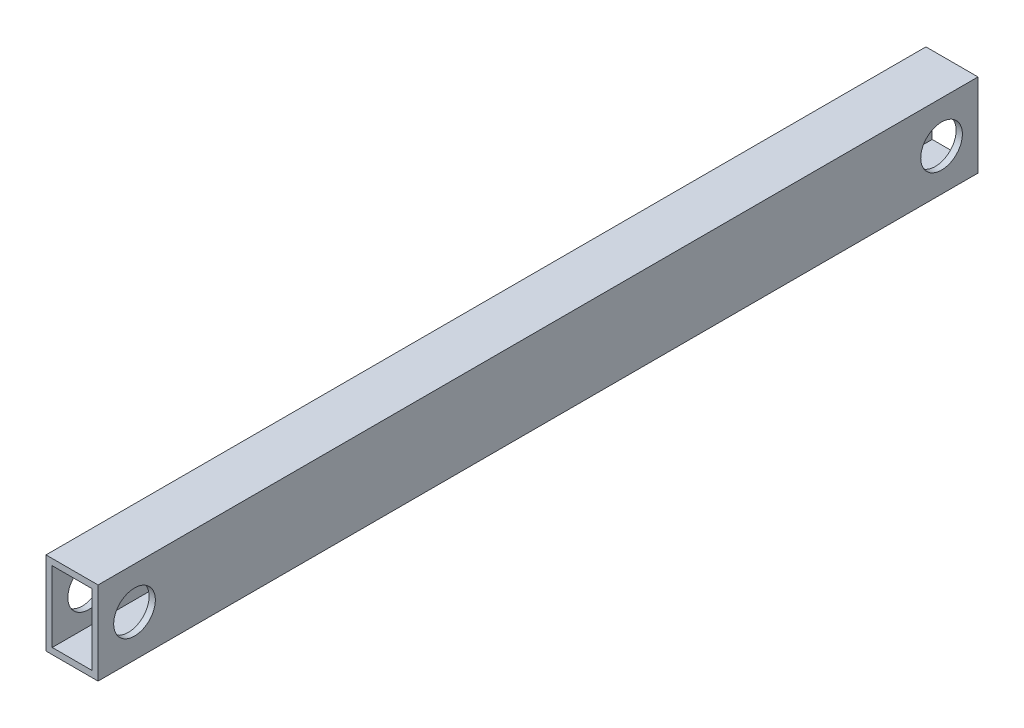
ISO-10303-21;
HEADER;
FILE_DESCRIPTION(('STEP AP214'),'2;1');
FILE_NAME('part.step','',(''),(''),'','','');
FILE_SCHEMA(('AUTOMOTIVE_DESIGN { 1 0 10303 214 1 1 1 1 }'));
ENDSEC;
DATA;
#1=APPLICATION_CONTEXT('core data for automotive mechanical design processes');
#2=APPLICATION_PROTOCOL_DEFINITION('international standard','automotive_design',2000,#1);
#3=PRODUCT_CONTEXT('',#1,'mechanical');
#4=PRODUCT('Part','Part','',(#3));
#5=PRODUCT_RELATED_PRODUCT_CATEGORY('part','',(#4));
#6=PRODUCT_DEFINITION_FORMATION('','',#4);
#7=PRODUCT_DEFINITION_CONTEXT('part definition',#1,'design');
#8=PRODUCT_DEFINITION('design','',#6,#7);
#9=PRODUCT_DEFINITION_SHAPE('','',#8);
#10=(LENGTH_UNIT() NAMED_UNIT(*) SI_UNIT(.MILLI.,.METRE.));
#11=(NAMED_UNIT(*) PLANE_ANGLE_UNIT() SI_UNIT($,.RADIAN.));
#12=(NAMED_UNIT(*) SI_UNIT($,.STERADIAN.) SOLID_ANGLE_UNIT());
#13=UNCERTAINTY_MEASURE_WITH_UNIT(LENGTH_MEASURE(1.E-05),#10,'distance_accuracy_value','');
#14=(GEOMETRIC_REPRESENTATION_CONTEXT(3) GLOBAL_UNCERTAINTY_ASSIGNED_CONTEXT((#13)) GLOBAL_UNIT_ASSIGNED_CONTEXT((#10,
#11,#12)) REPRESENTATION_CONTEXT('',''));
#15=CARTESIAN_POINT('',(0.,0.,0.));
#16=DIRECTION('',(0.,0.,1.));
#17=DIRECTION('',(1.,0.,0.));
#18=AXIS2_PLACEMENT_3D('',#15,#16,#17);
#19=CARTESIAN_POINT('',(0.,-80.0000000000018,845.));
#20=DIRECTION('',(0.,0.,1.));
#21=DIRECTION('',(1.,0.,0.));
#22=AXIS2_PLACEMENT_3D('',#19,#20,#21);
#23=PLANE('',#22);
#24=DIRECTION('',(0.,-1.,0.));
#25=VECTOR('',#24,1.);
#26=CARTESIAN_POINT('',(0.,-1.77635683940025E-12,845.));
#27=LINE('',#26,#25);
#28=CARTESIAN_POINT('',(0.,-1.77635683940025E-12,845.));
#29=VERTEX_POINT('',#28);
#30=CARTESIAN_POINT('',(0.,-80.0000000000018,845.));
#31=VERTEX_POINT('',#30);
#32=EDGE_CURVE('E207',#29,#31,#27,.T.);
#33=ORIENTED_EDGE('',*,*,#32,.T.);
#34=DIRECTION('',(1.,0.,0.));
#35=VECTOR('',#34,1.);
#36=CARTESIAN_POINT('',(0.,-80.0000000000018,845.));
#37=LINE('',#36,#35);
#38=CARTESIAN_POINT('',(50.,-80.0000000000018,845.));
#39=VERTEX_POINT('',#38);
#40=EDGE_CURVE('E210',#31,#39,#37,.T.);
#41=ORIENTED_EDGE('',*,*,#40,.T.);
#42=DIRECTION('',(0.,1.,0.));
#43=VECTOR('',#42,1.);
#44=CARTESIAN_POINT('',(50.,-1.77635683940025E-12,845.));
#45=LINE('',#44,#43);
#46=CARTESIAN_POINT('',(50.,-1.77635683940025E-12,845.));
#47=VERTEX_POINT('',#46);
#48=EDGE_CURVE('E212',#39,#47,#45,.T.);
#49=ORIENTED_EDGE('',*,*,#48,.T.);
#50=DIRECTION('',(-1.,0.,0.));
#51=VECTOR('',#50,1.);
#52=CARTESIAN_POINT('',(0.,-1.77635683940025E-12,845.));
#53=LINE('',#52,#51);
#54=EDGE_CURVE('E214',#47,#29,#53,.T.);
#55=ORIENTED_EDGE('',*,*,#54,.T.);
#56=EDGE_LOOP('',(#33,#41,#49,#55));
#57=FACE_BOUND('',#56,.T.);
#58=DIRECTION('',(1.,0.,0.));
#59=VECTOR('',#58,1.);
#60=CARTESIAN_POINT('',(0.,-73.9999999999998,845.));
#61=LINE('',#60,#59);
#62=CARTESIAN_POINT('',(6.00000000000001,-73.9999999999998,845.));
#63=VERTEX_POINT('',#62);
#64=CARTESIAN_POINT('',(44.,-73.9999999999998,845.));
#65=VERTEX_POINT('',#64);
#66=EDGE_CURVE('E189',#63,#65,#61,.T.);
#67=ORIENTED_EDGE('',*,*,#66,.F.);
#68=DIRECTION('',(0.,-1.,0.));
#69=VECTOR('',#68,1.);
#70=CARTESIAN_POINT('',(5.99999999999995,-1.77635683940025E-12,845.));
#71=LINE('',#70,#69);
#72=CARTESIAN_POINT('',(5.99999999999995,-6.00000000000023,845.));
#73=VERTEX_POINT('',#72);
#74=EDGE_CURVE('E173',#73,#63,#71,.T.);
#75=ORIENTED_EDGE('',*,*,#74,.F.);
#76=DIRECTION('',(-1.,0.,0.));
#77=VECTOR('',#76,1.);
#78=CARTESIAN_POINT('',(0.,-6.00000000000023,845.));
#79=LINE('',#78,#77);
#80=CARTESIAN_POINT('',(44.,-6.00000000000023,845.));
#81=VERTEX_POINT('',#80);
#82=EDGE_CURVE('E193',#81,#73,#79,.T.);
#83=ORIENTED_EDGE('',*,*,#82,.F.);
#84=DIRECTION('',(0.,1.,0.));
#85=VECTOR('',#84,1.);
#86=CARTESIAN_POINT('',(44.,-1.77635683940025E-12,845.));
#87=LINE('',#86,#85);
#88=EDGE_CURVE('E191',#65,#81,#87,.T.);
#89=ORIENTED_EDGE('',*,*,#88,.F.);
#90=EDGE_LOOP('',(#67,#75,#83,#89));
#91=FACE_BOUND('',#90,.T.);
#92=ADVANCED_FACE('F91',(#57,#91),#23,.T.);
#93=CARTESIAN_POINT('',(0.,-80.0000000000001,0.));
#94=DIRECTION('',(0.,0.,1.));
#95=DIRECTION('',(1.,0.,0.));
#96=AXIS2_PLACEMENT_3D('',#93,#94,#95);
#97=PLANE('',#96);
#98=DIRECTION('',(0.,-1.,0.));
#99=VECTOR('',#98,1.);
#100=CARTESIAN_POINT('',(0.,0.,0.));
#101=LINE('',#100,#99);
#102=CARTESIAN_POINT('',(0.,0.,0.));
#103=VERTEX_POINT('',#102);
#104=CARTESIAN_POINT('',(0.,-80.0000000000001,0.));
#105=VERTEX_POINT('',#104);
#106=EDGE_CURVE('E174',#103,#105,#101,.T.);
#107=ORIENTED_EDGE('',*,*,#106,.F.);
#108=DIRECTION('',(-1.,0.,0.));
#109=VECTOR('',#108,1.);
#110=CARTESIAN_POINT('',(0.,0.,0.));
#111=LINE('',#110,#109);
#112=CARTESIAN_POINT('',(50.,0.,0.));
#113=VERTEX_POINT('',#112);
#114=EDGE_CURVE('E205',#113,#103,#111,.T.);
#115=ORIENTED_EDGE('',*,*,#114,.F.);
#116=DIRECTION('',(0.,1.,0.));
#117=VECTOR('',#116,1.);
#118=CARTESIAN_POINT('',(50.,0.,0.));
#119=LINE('',#118,#117);
#120=CARTESIAN_POINT('',(50.,-80.0000000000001,0.));
#121=VERTEX_POINT('',#120);
#122=EDGE_CURVE('E203',#121,#113,#119,.T.);
#123=ORIENTED_EDGE('',*,*,#122,.F.);
#124=DIRECTION('',(1.,0.,0.));
#125=VECTOR('',#124,1.);
#126=CARTESIAN_POINT('',(0.,-80.0000000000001,0.));
#127=LINE('',#126,#125);
#128=EDGE_CURVE('E201',#105,#121,#127,.T.);
#129=ORIENTED_EDGE('',*,*,#128,.F.);
#130=EDGE_LOOP('',(#107,#115,#123,#129));
#131=FACE_BOUND('',#130,.T.);
#132=DIRECTION('',(0.,-1.,0.));
#133=VECTOR('',#132,1.);
#134=CARTESIAN_POINT('',(6.00000000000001,0.,0.));
#135=LINE('',#134,#133);
#136=CARTESIAN_POINT('',(6.00000000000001,-6.00000000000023,0.));
#137=VERTEX_POINT('',#136);
#138=CARTESIAN_POINT('',(6.00000000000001,-74.0000000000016,-2.22044604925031E-13));
#139=VERTEX_POINT('',#138);
#140=EDGE_CURVE('E116',#137,#139,#135,.T.);
#141=ORIENTED_EDGE('',*,*,#140,.T.);
#142=DIRECTION('',(1.,0.,0.));
#143=VECTOR('',#142,1.);
#144=CARTESIAN_POINT('',(0.,-74.0000000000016,-2.22044604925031E-13));
#145=LINE('',#144,#143);
#146=CARTESIAN_POINT('',(44.,-74.0000000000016,-4.44089209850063E-13));
#147=VERTEX_POINT('',#146);
#148=EDGE_CURVE('E160',#139,#147,#145,.T.);
#149=ORIENTED_EDGE('',*,*,#148,.T.);
#150=DIRECTION('',(0.,1.,0.));
#151=VECTOR('',#150,1.);
#152=CARTESIAN_POINT('',(44.,0.,0.));
#153=LINE('',#152,#151);
#154=CARTESIAN_POINT('',(44.,-6.00000000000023,2.22044604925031E-13));
#155=VERTEX_POINT('',#154);
#156=EDGE_CURVE('E169',#147,#155,#153,.T.);
#157=ORIENTED_EDGE('',*,*,#156,.T.);
#158=DIRECTION('',(-1.,0.,0.));
#159=VECTOR('',#158,1.);
#160=CARTESIAN_POINT('',(0.,-6.00000000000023,0.));
#161=LINE('',#160,#159);
#162=EDGE_CURVE('E178',#155,#137,#161,.T.);
#163=ORIENTED_EDGE('',*,*,#162,.T.);
#164=EDGE_LOOP('',(#141,#149,#157,#163));
#165=FACE_BOUND('',#164,.T.);
#166=ADVANCED_FACE('F177',(#131,#165),#97,.F.);
#167=CARTESIAN_POINT('',(0.,-1.77635683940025E-12,845.));
#168=DIRECTION('',(1.,0.,0.));
#169=DIRECTION('',(0.,1.,0.));
#170=AXIS2_PLACEMENT_3D('',#167,#168,#169);
#171=PLANE('',#170);
#172=CARTESIAN_POINT('',(0.,-40.,34.9999999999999));
#173=DIRECTION('',(1.,0.,0.));
#174=DIRECTION('',(0.,1.,0.));
#175=AXIS2_PLACEMENT_3D('',#172,#173,#174);
#176=CIRCLE('',#175,20.);
#177=CARTESIAN_POINT('',(0.,-20.,34.9999999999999));
#178=VERTEX_POINT('',#177);
#179=EDGE_CURVE('E237',#178,#178,#176,.T.);
#180=ORIENTED_EDGE('',*,*,#179,.T.);
#181=EDGE_LOOP('',(#180));
#182=FACE_BOUND('',#181,.T.);
#183=CARTESIAN_POINT('',(0.,-40.0000000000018,810.));
#184=DIRECTION('',(1.,0.,0.));
#185=DIRECTION('',(0.,1.,0.));
#186=AXIS2_PLACEMENT_3D('',#183,#184,#185);
#187=CIRCLE('',#186,20.0000000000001);
#188=CARTESIAN_POINT('',(0.,-20.0000000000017,810.));
#189=VERTEX_POINT('',#188);
#190=EDGE_CURVE('E224',#189,#189,#187,.T.);
#191=ORIENTED_EDGE('',*,*,#190,.T.);
#192=EDGE_LOOP('',(#191));
#193=FACE_BOUND('',#192,.T.);
#194=ORIENTED_EDGE('',*,*,#106,.T.);
#195=DIRECTION('',(0.,0.,-1.));
#196=VECTOR('',#195,1.);
#197=CARTESIAN_POINT('',(0.,-80.0000000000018,845.));
#198=LINE('',#197,#196);
#199=EDGE_CURVE('E14',#31,#105,#198,.T.);
#200=ORIENTED_EDGE('',*,*,#199,.F.);
#201=ORIENTED_EDGE('',*,*,#32,.F.);
#202=DIRECTION('',(0.,0.,-1.));
#203=VECTOR('',#202,1.);
#204=CARTESIAN_POINT('',(0.,-1.77635683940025E-12,845.));
#205=LINE('',#204,#203);
#206=EDGE_CURVE('E216',#29,#103,#205,.T.);
#207=ORIENTED_EDGE('',*,*,#206,.T.);
#208=EDGE_LOOP('',(#194,#200,#201,#207));
#209=FACE_BOUND('',#208,.T.);
#210=ADVANCED_FACE('F93',(#182,#193,#209),#171,.F.);
#211=CARTESIAN_POINT('',(0.,-80.0000000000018,845.));
#212=DIRECTION('',(0.,1.,0.));
#213=DIRECTION('',(0.,0.,1.));
#214=AXIS2_PLACEMENT_3D('',#211,#212,#213);
#215=PLANE('',#214);
#216=ORIENTED_EDGE('',*,*,#128,.T.);
#217=DIRECTION('',(0.,0.,-1.));
#218=VECTOR('',#217,1.);
#219=CARTESIAN_POINT('',(50.,-80.0000000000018,845.));
#220=LINE('',#219,#218);
#221=EDGE_CURVE('E100',#39,#121,#220,.T.);
#222=ORIENTED_EDGE('',*,*,#221,.F.);
#223=ORIENTED_EDGE('',*,*,#40,.F.);
#224=ORIENTED_EDGE('',*,*,#199,.T.);
#225=EDGE_LOOP('',(#216,#222,#223,#224));
#226=FACE_BOUND('',#225,.T.);
#227=ADVANCED_FACE('F250',(#226),#215,.F.);
#228=CARTESIAN_POINT('',(50.,-1.77635683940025E-12,845.));
#229=DIRECTION('',(-1.,0.,0.));
#230=DIRECTION('',(0.,-1.,0.));
#231=AXIS2_PLACEMENT_3D('',#228,#229,#230);
#232=PLANE('',#231);
#233=CARTESIAN_POINT('',(50.,-40.,34.9999999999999));
#234=DIRECTION('',(1.,0.,0.));
#235=DIRECTION('',(0.,1.,0.));
#236=AXIS2_PLACEMENT_3D('',#233,#234,#235);
#237=CIRCLE('',#236,20.);
#238=CARTESIAN_POINT('',(50.,-20.,34.9999999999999));
#239=VERTEX_POINT('',#238);
#240=EDGE_CURVE('E240',#239,#239,#237,.T.);
#241=ORIENTED_EDGE('',*,*,#240,.F.);
#242=EDGE_LOOP('',(#241));
#243=FACE_BOUND('',#242,.T.);
#244=CARTESIAN_POINT('',(50.,-40.0000000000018,809.999999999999));
#245=DIRECTION('',(1.,0.,0.));
#246=DIRECTION('',(0.,1.,0.));
#247=AXIS2_PLACEMENT_3D('',#244,#245,#246);
#248=CIRCLE('',#247,20.0000000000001);
#249=CARTESIAN_POINT('',(50.,-20.0000000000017,810.));
#250=VERTEX_POINT('',#249);
#251=EDGE_CURVE('E228',#250,#250,#248,.T.);
#252=ORIENTED_EDGE('',*,*,#251,.F.);
#253=EDGE_LOOP('',(#252));
#254=FACE_BOUND('',#253,.T.);
#255=ORIENTED_EDGE('',*,*,#122,.T.);
#256=DIRECTION('',(0.,0.,-1.));
#257=VECTOR('',#256,1.);
#258=CARTESIAN_POINT('',(50.,-1.77635683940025E-12,845.));
#259=LINE('',#258,#257);
#260=EDGE_CURVE('E219',#47,#113,#259,.T.);
#261=ORIENTED_EDGE('',*,*,#260,.F.);
#262=ORIENTED_EDGE('',*,*,#48,.F.);
#263=ORIENTED_EDGE('',*,*,#221,.T.);
#264=EDGE_LOOP('',(#255,#261,#262,#263));
#265=FACE_BOUND('',#264,.T.);
#266=ADVANCED_FACE('F246',(#243,#254,#265),#232,.F.);
#267=CARTESIAN_POINT('',(0.,-1.77635683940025E-12,845.));
#268=DIRECTION('',(0.,-1.,0.));
#269=DIRECTION('',(0.,0.,-1.));
#270=AXIS2_PLACEMENT_3D('',#267,#268,#269);
#271=PLANE('',#270);
#272=ORIENTED_EDGE('',*,*,#114,.T.);
#273=ORIENTED_EDGE('',*,*,#206,.F.);
#274=ORIENTED_EDGE('',*,*,#54,.F.);
#275=ORIENTED_EDGE('',*,*,#260,.T.);
#276=EDGE_LOOP('',(#272,#273,#274,#275));
#277=FACE_BOUND('',#276,.T.);
#278=ADVANCED_FACE('F249',(#277),#271,.F.);
#279=CARTESIAN_POINT('',(5.99999999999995,-1.77635683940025E-12,845.));
#280=DIRECTION('',(1.,0.,0.));
#281=DIRECTION('',(0.,1.,0.));
#282=AXIS2_PLACEMENT_3D('',#279,#280,#281);
#283=PLANE('',#282);
#284=CARTESIAN_POINT('',(6.00000000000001,-40.,34.9999999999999));
#285=DIRECTION('',(1.,0.,0.));
#286=DIRECTION('',(0.,1.,0.));
#287=AXIS2_PLACEMENT_3D('',#284,#285,#286);
#288=CIRCLE('',#287,20.);
#289=CARTESIAN_POINT('',(6.,-20.,34.9999999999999));
#290=VERTEX_POINT('',#289);
#291=EDGE_CURVE('E232',#290,#290,#288,.T.);
#292=ORIENTED_EDGE('',*,*,#291,.F.);
#293=EDGE_LOOP('',(#292));
#294=FACE_BOUND('',#293,.T.);
#295=CARTESIAN_POINT('',(6.00000000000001,-40.0000000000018,810.));
#296=DIRECTION('',(1.,0.,0.));
#297=DIRECTION('',(0.,1.,0.));
#298=AXIS2_PLACEMENT_3D('',#295,#296,#297);
#299=CIRCLE('',#298,20.0000000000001);
#300=CARTESIAN_POINT('',(6.,-20.0000000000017,810.));
#301=VERTEX_POINT('',#300);
#302=EDGE_CURVE('E179',#301,#301,#299,.T.);
#303=ORIENTED_EDGE('',*,*,#302,.F.);
#304=EDGE_LOOP('',(#303));
#305=FACE_BOUND('',#304,.T.);
#306=ORIENTED_EDGE('',*,*,#140,.F.);
#307=DIRECTION('',(0.,0.,-1.));
#308=VECTOR('',#307,1.);
#309=CARTESIAN_POINT('',(5.99999999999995,-6.00000000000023,845.));
#310=LINE('',#309,#308);
#311=EDGE_CURVE('E195',#73,#137,#310,.T.);
#312=ORIENTED_EDGE('',*,*,#311,.F.);
#313=ORIENTED_EDGE('',*,*,#74,.T.);
#314=DIRECTION('',(0.,0.,-1.));
#315=VECTOR('',#314,1.);
#316=CARTESIAN_POINT('',(6.00000000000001,-73.9999999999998,845.));
#317=LINE('',#316,#315);
#318=EDGE_CURVE('E162',#63,#139,#317,.T.);
#319=ORIENTED_EDGE('',*,*,#318,.T.);
#320=EDGE_LOOP('',(#306,#312,#313,#319));
#321=FACE_BOUND('',#320,.T.);
#322=ADVANCED_FACE('F171',(#294,#305,#321),#283,.T.);
#323=CARTESIAN_POINT('',(0.,-73.9999999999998,845.));
#324=DIRECTION('',(0.,1.,0.));
#325=DIRECTION('',(0.,0.,1.));
#326=AXIS2_PLACEMENT_3D('',#323,#324,#325);
#327=PLANE('',#326);
#328=ORIENTED_EDGE('',*,*,#148,.F.);
#329=ORIENTED_EDGE('',*,*,#318,.F.);
#330=ORIENTED_EDGE('',*,*,#66,.T.);
#331=DIRECTION('',(0.,0.,-1.));
#332=VECTOR('',#331,1.);
#333=CARTESIAN_POINT('',(44.,-73.9999999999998,845.));
#334=LINE('',#333,#332);
#335=EDGE_CURVE('E165',#65,#147,#334,.T.);
#336=ORIENTED_EDGE('',*,*,#335,.T.);
#337=EDGE_LOOP('',(#328,#329,#330,#336));
#338=FACE_BOUND('',#337,.T.);
#339=ADVANCED_FACE('F161',(#338),#327,.T.);
#340=CARTESIAN_POINT('',(44.,-1.77635683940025E-12,845.));
#341=DIRECTION('',(-1.,0.,0.));
#342=DIRECTION('',(0.,-1.,0.));
#343=AXIS2_PLACEMENT_3D('',#340,#341,#342);
#344=PLANE('',#343);
#345=CARTESIAN_POINT('',(44.,-40.,35.0000000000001));
#346=DIRECTION('',(-1.,0.,0.));
#347=DIRECTION('',(0.,-1.,0.));
#348=AXIS2_PLACEMENT_3D('',#345,#346,#347);
#349=CIRCLE('',#348,20.);
#350=CARTESIAN_POINT('',(44.,-20.,34.9999999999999));
#351=VERTEX_POINT('',#350);
#352=EDGE_CURVE('E95',#351,#351,#349,.T.);
#353=ORIENTED_EDGE('',*,*,#352,.F.);
#354=EDGE_LOOP('',(#353));
#355=FACE_BOUND('',#354,.T.);
#356=CARTESIAN_POINT('',(44.,-40.0000000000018,809.999999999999));
#357=DIRECTION('',(-1.,0.,0.));
#358=DIRECTION('',(0.,-1.,0.));
#359=AXIS2_PLACEMENT_3D('',#356,#357,#358);
#360=CIRCLE('',#359,20.0000000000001);
#361=CARTESIAN_POINT('',(44.,-20.0000000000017,810.));
#362=VERTEX_POINT('',#361);
#363=EDGE_CURVE('E182',#362,#362,#360,.T.);
#364=ORIENTED_EDGE('',*,*,#363,.F.);
#365=EDGE_LOOP('',(#364));
#366=FACE_BOUND('',#365,.T.);
#367=ORIENTED_EDGE('',*,*,#156,.F.);
#368=ORIENTED_EDGE('',*,*,#335,.F.);
#369=ORIENTED_EDGE('',*,*,#88,.T.);
#370=DIRECTION('',(0.,0.,-1.));
#371=VECTOR('',#370,1.);
#372=CARTESIAN_POINT('',(44.,-6.00000000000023,845.));
#373=LINE('',#372,#371);
#374=EDGE_CURVE('E108',#81,#155,#373,.T.);
#375=ORIENTED_EDGE('',*,*,#374,.T.);
#376=EDGE_LOOP('',(#367,#368,#369,#375));
#377=FACE_BOUND('',#376,.T.);
#378=ADVANCED_FACE('F291',(#355,#366,#377),#344,.T.);
#379=CARTESIAN_POINT('',(0.,-6.00000000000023,845.));
#380=DIRECTION('',(0.,-1.,0.));
#381=DIRECTION('',(0.,0.,-1.));
#382=AXIS2_PLACEMENT_3D('',#379,#380,#381);
#383=PLANE('',#382);
#384=ORIENTED_EDGE('',*,*,#162,.F.);
#385=ORIENTED_EDGE('',*,*,#374,.F.);
#386=ORIENTED_EDGE('',*,*,#82,.T.);
#387=ORIENTED_EDGE('',*,*,#311,.T.);
#388=EDGE_LOOP('',(#384,#385,#386,#387));
#389=FACE_BOUND('',#388,.T.);
#390=ADVANCED_FACE('F298',(#389),#383,.T.);
#391=CARTESIAN_POINT('',(0.,-40.0000000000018,810.));
#392=DIRECTION('',(1.,0.,0.));
#393=DIRECTION('',(0.,1.,0.));
#394=AXIS2_PLACEMENT_3D('',#391,#392,#393);
#395=CYLINDRICAL_SURFACE('',#394,20.0000000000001);
#396=CARTESIAN_POINT('',(44.,-20.0000000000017,810.));
#397=CARTESIAN_POINT('',(44.0625,-20.0000000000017,810.));
#398=CARTESIAN_POINT('',(44.125,-20.0000000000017,810.));
#399=CARTESIAN_POINT('',(44.25,-20.0000000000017,810.));
#400=CARTESIAN_POINT('',(44.3125,-20.0000000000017,810.));
#401=CARTESIAN_POINT('',(44.4375,-20.0000000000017,810.));
#402=CARTESIAN_POINT('',(44.5,-20.0000000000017,810.));
#403=CARTESIAN_POINT('',(44.625,-20.0000000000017,810.));
#404=CARTESIAN_POINT('',(44.6875,-20.0000000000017,810.));
#405=CARTESIAN_POINT('',(44.8125,-20.0000000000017,810.));
#406=CARTESIAN_POINT('',(44.875,-20.0000000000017,810.));
#407=CARTESIAN_POINT('',(45.,-20.0000000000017,810.));
#408=CARTESIAN_POINT('',(45.0625,-20.0000000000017,810.));
#409=CARTESIAN_POINT('',(45.1875,-20.0000000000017,810.));
#410=CARTESIAN_POINT('',(45.25,-20.0000000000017,810.));
#411=CARTESIAN_POINT('',(45.375,-20.0000000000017,810.));
#412=CARTESIAN_POINT('',(45.4375,-20.0000000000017,810.));
#413=CARTESIAN_POINT('',(45.5625,-20.0000000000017,810.));
#414=CARTESIAN_POINT('',(45.625,-20.0000000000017,810.));
#415=CARTESIAN_POINT('',(45.75,-20.0000000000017,810.));
#416=CARTESIAN_POINT('',(45.8125,-20.0000000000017,810.));
#417=CARTESIAN_POINT('',(45.9375,-20.0000000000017,810.));
#418=CARTESIAN_POINT('',(46.,-20.0000000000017,810.));
#419=CARTESIAN_POINT('',(46.125,-20.0000000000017,810.));
#420=CARTESIAN_POINT('',(46.1875,-20.0000000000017,810.));
#421=CARTESIAN_POINT('',(46.3125,-20.0000000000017,810.));
#422=CARTESIAN_POINT('',(46.375,-20.0000000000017,810.));
#423=CARTESIAN_POINT('',(46.5,-20.0000000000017,810.));
#424=CARTESIAN_POINT('',(46.5625,-20.0000000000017,810.));
#425=CARTESIAN_POINT('',(46.6875,-20.0000000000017,810.));
#426=CARTESIAN_POINT('',(46.75,-20.0000000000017,810.));
#427=CARTESIAN_POINT('',(46.875,-20.0000000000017,810.));
#428=CARTESIAN_POINT('',(46.9375,-20.0000000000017,810.));
#429=CARTESIAN_POINT('',(47.0625,-20.0000000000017,810.));
#430=CARTESIAN_POINT('',(47.125,-20.0000000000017,810.));
#431=CARTESIAN_POINT('',(47.25,-20.0000000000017,810.));
#432=CARTESIAN_POINT('',(47.3125,-20.0000000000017,810.));
#433=CARTESIAN_POINT('',(47.4375,-20.0000000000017,810.));
#434=CARTESIAN_POINT('',(47.5,-20.0000000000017,810.));
#435=CARTESIAN_POINT('',(47.625,-20.0000000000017,810.));
#436=CARTESIAN_POINT('',(47.6875,-20.0000000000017,810.));
#437=CARTESIAN_POINT('',(47.8125,-20.0000000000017,810.));
#438=CARTESIAN_POINT('',(47.875,-20.0000000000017,810.));
#439=CARTESIAN_POINT('',(48.,-20.0000000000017,810.));
#440=CARTESIAN_POINT('',(48.0625,-20.0000000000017,810.));
#441=CARTESIAN_POINT('',(48.1875,-20.0000000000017,810.));
#442=CARTESIAN_POINT('',(48.25,-20.0000000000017,810.));
#443=CARTESIAN_POINT('',(48.375,-20.0000000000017,810.));
#444=CARTESIAN_POINT('',(48.4375,-20.0000000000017,810.));
#445=CARTESIAN_POINT('',(48.5625,-20.0000000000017,810.));
#446=CARTESIAN_POINT('',(48.625,-20.0000000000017,810.));
#447=CARTESIAN_POINT('',(48.75,-20.0000000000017,810.));
#448=CARTESIAN_POINT('',(48.8125,-20.0000000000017,810.));
#449=CARTESIAN_POINT('',(48.9375,-20.0000000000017,810.));
#450=CARTESIAN_POINT('',(49.,-20.0000000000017,810.));
#451=CARTESIAN_POINT('',(49.125,-20.0000000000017,810.));
#452=CARTESIAN_POINT('',(49.1875,-20.0000000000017,810.));
#453=CARTESIAN_POINT('',(49.3125,-20.0000000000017,810.));
#454=CARTESIAN_POINT('',(49.375,-20.0000000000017,810.));
#455=CARTESIAN_POINT('',(49.5,-20.0000000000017,810.));
#456=CARTESIAN_POINT('',(49.5625,-20.0000000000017,810.));
#457=CARTESIAN_POINT('',(49.6875,-20.0000000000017,810.));
#458=CARTESIAN_POINT('',(49.75,-20.0000000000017,810.));
#459=CARTESIAN_POINT('',(49.875,-20.0000000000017,810.));
#460=CARTESIAN_POINT('',(49.9375,-20.0000000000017,810.));
#461=CARTESIAN_POINT('',(50.,-20.0000000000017,810.));
#462=B_SPLINE_CURVE_WITH_KNOTS('',3,(#396,#397,#398,#399,#400,#401,#402,#403,#404,#405,#406,
#407,#408,#409,#410,#411,#412,#413,#414,#415,#416,#417,#418,#419,#420,#421,#422,#423,#424,#425,
#426,#427,#428,#429,#430,#431,#432,#433,#434,#435,#436,#437,#438,#439,#440,#441,#442,#443,#444,
#445,#446,#447,#448,#449,#450,#451,#452,#453,#454,#455,#456,#457,#458,#459,#460,#461),
.UNSPECIFIED.,.F.,.F.,(4,2,2,2,2,2,2,2,2,2,2,2,2,2,2,2,2,2,2,2,2,2,2,2,2,2,2,2,2,2,2,2,4),(0.,
0.1875,0.375,0.5625,0.750000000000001,0.937500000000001,1.125,1.3125,1.5,1.6875,1.875,2.0625,
2.25,2.4375,2.625,2.8125,3.,3.1875,3.375,3.5625,3.75,3.9375,4.125,4.3125,4.5,4.6875,4.875,
5.0625,5.25,5.4375,5.62500000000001,5.81250000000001,6.00000000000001),.UNSPECIFIED.);
#463=EDGE_CURVE('BSEAM302',#362,#250,#462,.T.);
#464=ORIENTED_EDGE('',*,*,#363,.T.);
#465=ORIENTED_EDGE('',*,*,#251,.T.);
#466=ORIENTED_EDGE('',*,*,#463,.T.);
#467=ORIENTED_EDGE('',*,*,#463,.F.);
#468=EDGE_LOOP('',(#464,#466,#465,#467));
#469=FACE_BOUND('',#468,.T.);
#470=ADVANCED_FACE('F302',(#469),#395,.F.);
#471=CARTESIAN_POINT('',(6.,-20.0000000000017,810.));
#472=CARTESIAN_POINT('',(5.9375,-20.0000000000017,810.));
#473=CARTESIAN_POINT('',(5.875,-20.0000000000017,810.));
#474=CARTESIAN_POINT('',(5.75,-20.0000000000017,810.));
#475=CARTESIAN_POINT('',(5.6875,-20.0000000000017,810.));
#476=CARTESIAN_POINT('',(5.5625,-20.0000000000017,810.));
#477=CARTESIAN_POINT('',(5.5,-20.0000000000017,810.));
#478=CARTESIAN_POINT('',(5.375,-20.0000000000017,810.));
#479=CARTESIAN_POINT('',(5.3125,-20.0000000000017,810.));
#480=CARTESIAN_POINT('',(5.1875,-20.0000000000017,810.));
#481=CARTESIAN_POINT('',(5.125,-20.0000000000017,810.));
#482=CARTESIAN_POINT('',(5.,-20.0000000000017,810.));
#483=CARTESIAN_POINT('',(4.9375,-20.0000000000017,810.));
#484=CARTESIAN_POINT('',(4.8125,-20.0000000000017,810.));
#485=CARTESIAN_POINT('',(4.75,-20.0000000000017,810.));
#486=CARTESIAN_POINT('',(4.625,-20.0000000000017,810.));
#487=CARTESIAN_POINT('',(4.5625,-20.0000000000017,810.));
#488=CARTESIAN_POINT('',(4.4375,-20.0000000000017,810.));
#489=CARTESIAN_POINT('',(4.375,-20.0000000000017,810.));
#490=CARTESIAN_POINT('',(4.25,-20.0000000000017,810.));
#491=CARTESIAN_POINT('',(4.1875,-20.0000000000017,810.));
#492=CARTESIAN_POINT('',(4.0625,-20.0000000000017,810.));
#493=CARTESIAN_POINT('',(4.,-20.0000000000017,810.));
#494=CARTESIAN_POINT('',(3.875,-20.0000000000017,810.));
#495=CARTESIAN_POINT('',(3.8125,-20.0000000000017,810.));
#496=CARTESIAN_POINT('',(3.6875,-20.0000000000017,810.));
#497=CARTESIAN_POINT('',(3.625,-20.0000000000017,810.));
#498=CARTESIAN_POINT('',(3.5,-20.0000000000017,810.));
#499=CARTESIAN_POINT('',(3.4375,-20.0000000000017,810.));
#500=CARTESIAN_POINT('',(3.3125,-20.0000000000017,810.));
#501=CARTESIAN_POINT('',(3.25,-20.0000000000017,810.));
#502=CARTESIAN_POINT('',(3.125,-20.0000000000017,810.));
#503=CARTESIAN_POINT('',(3.0625,-20.0000000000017,810.));
#504=CARTESIAN_POINT('',(2.9375,-20.0000000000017,810.));
#505=CARTESIAN_POINT('',(2.875,-20.0000000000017,810.));
#506=CARTESIAN_POINT('',(2.75,-20.0000000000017,810.));
#507=CARTESIAN_POINT('',(2.6875,-20.0000000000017,810.));
#508=CARTESIAN_POINT('',(2.5625,-20.0000000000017,810.));
#509=CARTESIAN_POINT('',(2.5,-20.0000000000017,810.));
#510=CARTESIAN_POINT('',(2.375,-20.0000000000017,810.));
#511=CARTESIAN_POINT('',(2.3125,-20.0000000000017,810.));
#512=CARTESIAN_POINT('',(2.1875,-20.0000000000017,810.));
#513=CARTESIAN_POINT('',(2.125,-20.0000000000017,810.));
#514=CARTESIAN_POINT('',(2.,-20.0000000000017,810.));
#515=CARTESIAN_POINT('',(1.9375,-20.0000000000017,810.));
#516=CARTESIAN_POINT('',(1.8125,-20.0000000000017,810.));
#517=CARTESIAN_POINT('',(1.75,-20.0000000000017,810.));
#518=CARTESIAN_POINT('',(1.625,-20.0000000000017,810.));
#519=CARTESIAN_POINT('',(1.5625,-20.0000000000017,810.));
#520=CARTESIAN_POINT('',(1.4375,-20.0000000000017,810.));
#521=CARTESIAN_POINT('',(1.375,-20.0000000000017,810.));
#522=CARTESIAN_POINT('',(1.25,-20.0000000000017,810.));
#523=CARTESIAN_POINT('',(1.1875,-20.0000000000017,810.));
#524=CARTESIAN_POINT('',(1.0625,-20.0000000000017,810.));
#525=CARTESIAN_POINT('',(0.999999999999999,-20.0000000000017,810.));
#526=CARTESIAN_POINT('',(0.874999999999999,-20.0000000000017,810.));
#527=CARTESIAN_POINT('',(0.812499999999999,-20.0000000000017,810.));
#528=CARTESIAN_POINT('',(0.687499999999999,-20.0000000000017,810.));
#529=CARTESIAN_POINT('',(0.624999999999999,-20.0000000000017,810.));
#530=CARTESIAN_POINT('',(0.499999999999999,-20.0000000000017,810.));
#531=CARTESIAN_POINT('',(0.437499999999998,-20.0000000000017,810.));
#532=CARTESIAN_POINT('',(0.312499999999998,-20.0000000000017,810.));
#533=CARTESIAN_POINT('',(0.249999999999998,-20.0000000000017,810.));
#534=CARTESIAN_POINT('',(0.124999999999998,-20.0000000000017,810.));
#535=CARTESIAN_POINT('',(0.0624999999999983,-20.0000000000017,810.));
#536=CARTESIAN_POINT('',(0.,-20.0000000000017,810.));
#537=B_SPLINE_CURVE_WITH_KNOTS('',3,(#471,#472,#473,#474,#475,#476,#477,#478,#479,#480,#481,
#482,#483,#484,#485,#486,#487,#488,#489,#490,#491,#492,#493,#494,#495,#496,#497,#498,#499,#500,
#501,#502,#503,#504,#505,#506,#507,#508,#509,#510,#511,#512,#513,#514,#515,#516,#517,#518,#519,
#520,#521,#522,#523,#524,#525,#526,#527,#528,#529,#530,#531,#532,#533,#534,#535,#536),
.UNSPECIFIED.,.F.,.F.,(4,2,2,2,2,2,2,2,2,2,2,2,2,2,2,2,2,2,2,2,2,2,2,2,2,2,2,2,2,2,2,2,4),(0.,
0.1875,0.375,0.5625,0.750000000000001,0.937500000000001,1.125,1.3125,1.5,1.6875,1.875,2.0625,
2.25,2.4375,2.625,2.8125,3.,3.1875,3.375,3.5625,3.75,3.9375,4.125,4.3125,4.5,4.6875,4.875,
5.0625,5.25,5.4375,5.62500000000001,5.81250000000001,6.00000000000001),.UNSPECIFIED.);
#538=EDGE_CURVE('BSEAM305',#301,#189,#537,.T.);
#539=ORIENTED_EDGE('',*,*,#302,.T.);
#540=ORIENTED_EDGE('',*,*,#190,.F.);
#541=ORIENTED_EDGE('',*,*,#538,.T.);
#542=ORIENTED_EDGE('',*,*,#538,.F.);
#543=EDGE_LOOP('',(#539,#541,#540,#542));
#544=FACE_BOUND('',#543,.T.);
#545=ADVANCED_FACE('F305',(#544),#395,.F.);
#546=CARTESIAN_POINT('',(0.,-40.,34.9999999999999));
#547=DIRECTION('',(1.,0.,0.));
#548=DIRECTION('',(0.,1.,0.));
#549=AXIS2_PLACEMENT_3D('',#546,#547,#548);
#550=CYLINDRICAL_SURFACE('',#549,20.);
#551=CARTESIAN_POINT('',(44.,-20.,34.9999999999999));
#552=CARTESIAN_POINT('',(44.0625,-20.,34.9999999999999));
#553=CARTESIAN_POINT('',(44.125,-20.,34.9999999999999));
#554=CARTESIAN_POINT('',(44.25,-20.,34.9999999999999));
#555=CARTESIAN_POINT('',(44.3125,-20.,34.9999999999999));
#556=CARTESIAN_POINT('',(44.4375,-20.,34.9999999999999));
#557=CARTESIAN_POINT('',(44.5,-20.,34.9999999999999));
#558=CARTESIAN_POINT('',(44.625,-20.,34.9999999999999));
#559=CARTESIAN_POINT('',(44.6875,-20.,34.9999999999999));
#560=CARTESIAN_POINT('',(44.8125,-20.,34.9999999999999));
#561=CARTESIAN_POINT('',(44.875,-20.,34.9999999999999));
#562=CARTESIAN_POINT('',(45.,-20.,34.9999999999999));
#563=CARTESIAN_POINT('',(45.0625,-20.,34.9999999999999));
#564=CARTESIAN_POINT('',(45.1875,-20.,34.9999999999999));
#565=CARTESIAN_POINT('',(45.25,-20.,34.9999999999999));
#566=CARTESIAN_POINT('',(45.375,-20.,34.9999999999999));
#567=CARTESIAN_POINT('',(45.4375,-20.,34.9999999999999));
#568=CARTESIAN_POINT('',(45.5625,-20.,34.9999999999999));
#569=CARTESIAN_POINT('',(45.625,-20.,34.9999999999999));
#570=CARTESIAN_POINT('',(45.75,-20.,34.9999999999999));
#571=CARTESIAN_POINT('',(45.8125,-20.,34.9999999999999));
#572=CARTESIAN_POINT('',(45.9375,-20.,34.9999999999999));
#573=CARTESIAN_POINT('',(46.,-20.,34.9999999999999));
#574=CARTESIAN_POINT('',(46.125,-20.,34.9999999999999));
#575=CARTESIAN_POINT('',(46.1875,-20.,34.9999999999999));
#576=CARTESIAN_POINT('',(46.3125,-20.,34.9999999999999));
#577=CARTESIAN_POINT('',(46.375,-20.,34.9999999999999));
#578=CARTESIAN_POINT('',(46.5,-20.,34.9999999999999));
#579=CARTESIAN_POINT('',(46.5625,-20.,34.9999999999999));
#580=CARTESIAN_POINT('',(46.6875,-20.,34.9999999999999));
#581=CARTESIAN_POINT('',(46.75,-20.,34.9999999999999));
#582=CARTESIAN_POINT('',(46.875,-20.,34.9999999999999));
#583=CARTESIAN_POINT('',(46.9375,-20.,34.9999999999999));
#584=CARTESIAN_POINT('',(47.0625,-20.,34.9999999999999));
#585=CARTESIAN_POINT('',(47.125,-20.,34.9999999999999));
#586=CARTESIAN_POINT('',(47.25,-20.,34.9999999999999));
#587=CARTESIAN_POINT('',(47.3125,-20.,34.9999999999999));
#588=CARTESIAN_POINT('',(47.4375,-20.,34.9999999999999));
#589=CARTESIAN_POINT('',(47.5,-20.,34.9999999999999));
#590=CARTESIAN_POINT('',(47.625,-20.,34.9999999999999));
#591=CARTESIAN_POINT('',(47.6875,-20.,34.9999999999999));
#592=CARTESIAN_POINT('',(47.8125,-20.,34.9999999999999));
#593=CARTESIAN_POINT('',(47.875,-20.,34.9999999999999));
#594=CARTESIAN_POINT('',(48.,-20.,34.9999999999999));
#595=CARTESIAN_POINT('',(48.0625,-20.,34.9999999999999));
#596=CARTESIAN_POINT('',(48.1875,-20.,34.9999999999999));
#597=CARTESIAN_POINT('',(48.25,-20.,34.9999999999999));
#598=CARTESIAN_POINT('',(48.375,-20.,34.9999999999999));
#599=CARTESIAN_POINT('',(48.4375,-20.,34.9999999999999));
#600=CARTESIAN_POINT('',(48.5625,-20.,34.9999999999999));
#601=CARTESIAN_POINT('',(48.625,-20.,34.9999999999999));
#602=CARTESIAN_POINT('',(48.75,-20.,34.9999999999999));
#603=CARTESIAN_POINT('',(48.8125,-20.,34.9999999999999));
#604=CARTESIAN_POINT('',(48.9375,-20.,34.9999999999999));
#605=CARTESIAN_POINT('',(49.,-20.,34.9999999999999));
#606=CARTESIAN_POINT('',(49.125,-20.,34.9999999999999));
#607=CARTESIAN_POINT('',(49.1875,-20.,34.9999999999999));
#608=CARTESIAN_POINT('',(49.3125,-20.,34.9999999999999));
#609=CARTESIAN_POINT('',(49.375,-20.,34.9999999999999));
#610=CARTESIAN_POINT('',(49.5,-20.,34.9999999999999));
#611=CARTESIAN_POINT('',(49.5625,-20.,34.9999999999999));
#612=CARTESIAN_POINT('',(49.6875,-20.,34.9999999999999));
#613=CARTESIAN_POINT('',(49.75,-20.,34.9999999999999));
#614=CARTESIAN_POINT('',(49.875,-20.,34.9999999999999));
#615=CARTESIAN_POINT('',(49.9375,-20.,34.9999999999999));
#616=CARTESIAN_POINT('',(50.,-20.,34.9999999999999));
#617=B_SPLINE_CURVE_WITH_KNOTS('',3,(#551,#552,#553,#554,#555,#556,#557,#558,#559,#560,#561,
#562,#563,#564,#565,#566,#567,#568,#569,#570,#571,#572,#573,#574,#575,#576,#577,#578,#579,#580,
#581,#582,#583,#584,#585,#586,#587,#588,#589,#590,#591,#592,#593,#594,#595,#596,#597,#598,#599,
#600,#601,#602,#603,#604,#605,#606,#607,#608,#609,#610,#611,#612,#613,#614,#615,#616),
.UNSPECIFIED.,.F.,.F.,(4,2,2,2,2,2,2,2,2,2,2,2,2,2,2,2,2,2,2,2,2,2,2,2,2,2,2,2,2,2,2,2,4),(0.,
0.1875,0.375,0.5625,0.750000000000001,0.937500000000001,1.125,1.3125,1.5,1.6875,1.875,2.0625,
2.25,2.4375,2.625,2.8125,3.,3.1875,3.375,3.5625,3.75,3.9375,4.125,4.3125,4.5,4.6875,4.875,
5.0625,5.25,5.4375,5.62500000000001,5.81250000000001,6.00000000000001),.UNSPECIFIED.);
#618=EDGE_CURVE('BSEAM244',#351,#239,#617,.T.);
#619=ORIENTED_EDGE('',*,*,#352,.T.);
#620=ORIENTED_EDGE('',*,*,#240,.T.);
#621=ORIENTED_EDGE('',*,*,#618,.T.);
#622=ORIENTED_EDGE('',*,*,#618,.F.);
#623=EDGE_LOOP('',(#619,#621,#620,#622));
#624=FACE_BOUND('',#623,.T.);
#625=ADVANCED_FACE('F244',(#624),#550,.F.);
#626=CARTESIAN_POINT('',(6.,-20.,34.9999999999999));
#627=CARTESIAN_POINT('',(5.9375,-20.,34.9999999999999));
#628=CARTESIAN_POINT('',(5.875,-20.,34.9999999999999));
#629=CARTESIAN_POINT('',(5.75,-20.,34.9999999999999));
#630=CARTESIAN_POINT('',(5.6875,-20.,34.9999999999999));
#631=CARTESIAN_POINT('',(5.5625,-20.,34.9999999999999));
#632=CARTESIAN_POINT('',(5.5,-20.,34.9999999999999));
#633=CARTESIAN_POINT('',(5.375,-20.,34.9999999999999));
#634=CARTESIAN_POINT('',(5.3125,-20.,34.9999999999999));
#635=CARTESIAN_POINT('',(5.1875,-20.,34.9999999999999));
#636=CARTESIAN_POINT('',(5.125,-20.,34.9999999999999));
#637=CARTESIAN_POINT('',(5.,-20.,34.9999999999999));
#638=CARTESIAN_POINT('',(4.9375,-20.,34.9999999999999));
#639=CARTESIAN_POINT('',(4.8125,-20.,34.9999999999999));
#640=CARTESIAN_POINT('',(4.75,-20.,34.9999999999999));
#641=CARTESIAN_POINT('',(4.625,-20.,34.9999999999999));
#642=CARTESIAN_POINT('',(4.5625,-20.,34.9999999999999));
#643=CARTESIAN_POINT('',(4.4375,-20.,34.9999999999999));
#644=CARTESIAN_POINT('',(4.375,-20.,34.9999999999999));
#645=CARTESIAN_POINT('',(4.25,-20.,34.9999999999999));
#646=CARTESIAN_POINT('',(4.1875,-20.,34.9999999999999));
#647=CARTESIAN_POINT('',(4.0625,-20.,34.9999999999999));
#648=CARTESIAN_POINT('',(4.,-20.,34.9999999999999));
#649=CARTESIAN_POINT('',(3.875,-20.,34.9999999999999));
#650=CARTESIAN_POINT('',(3.8125,-20.,34.9999999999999));
#651=CARTESIAN_POINT('',(3.6875,-20.,34.9999999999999));
#652=CARTESIAN_POINT('',(3.625,-20.,34.9999999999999));
#653=CARTESIAN_POINT('',(3.5,-20.,34.9999999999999));
#654=CARTESIAN_POINT('',(3.4375,-20.,34.9999999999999));
#655=CARTESIAN_POINT('',(3.3125,-20.,34.9999999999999));
#656=CARTESIAN_POINT('',(3.25,-20.,34.9999999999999));
#657=CARTESIAN_POINT('',(3.125,-20.,34.9999999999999));
#658=CARTESIAN_POINT('',(3.0625,-20.,34.9999999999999));
#659=CARTESIAN_POINT('',(2.9375,-20.,34.9999999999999));
#660=CARTESIAN_POINT('',(2.875,-20.,34.9999999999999));
#661=CARTESIAN_POINT('',(2.75,-20.,34.9999999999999));
#662=CARTESIAN_POINT('',(2.6875,-20.,34.9999999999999));
#663=CARTESIAN_POINT('',(2.5625,-20.,34.9999999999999));
#664=CARTESIAN_POINT('',(2.5,-20.,34.9999999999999));
#665=CARTESIAN_POINT('',(2.375,-20.,34.9999999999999));
#666=CARTESIAN_POINT('',(2.3125,-20.,34.9999999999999));
#667=CARTESIAN_POINT('',(2.1875,-20.,34.9999999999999));
#668=CARTESIAN_POINT('',(2.125,-20.,34.9999999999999));
#669=CARTESIAN_POINT('',(2.,-20.,34.9999999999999));
#670=CARTESIAN_POINT('',(1.9375,-20.,34.9999999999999));
#671=CARTESIAN_POINT('',(1.8125,-20.,34.9999999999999));
#672=CARTESIAN_POINT('',(1.75,-20.,34.9999999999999));
#673=CARTESIAN_POINT('',(1.625,-20.,34.9999999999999));
#674=CARTESIAN_POINT('',(1.5625,-20.,34.9999999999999));
#675=CARTESIAN_POINT('',(1.4375,-20.,34.9999999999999));
#676=CARTESIAN_POINT('',(1.375,-20.,34.9999999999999));
#677=CARTESIAN_POINT('',(1.25,-20.,34.9999999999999));
#678=CARTESIAN_POINT('',(1.1875,-20.,34.9999999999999));
#679=CARTESIAN_POINT('',(1.0625,-20.,34.9999999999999));
#680=CARTESIAN_POINT('',(0.999999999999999,-20.,34.9999999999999));
#681=CARTESIAN_POINT('',(0.874999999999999,-20.,34.9999999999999));
#682=CARTESIAN_POINT('',(0.812499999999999,-20.,34.9999999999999));
#683=CARTESIAN_POINT('',(0.687499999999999,-20.,34.9999999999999));
#684=CARTESIAN_POINT('',(0.624999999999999,-20.,34.9999999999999));
#685=CARTESIAN_POINT('',(0.499999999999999,-20.,34.9999999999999));
#686=CARTESIAN_POINT('',(0.437499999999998,-20.,34.9999999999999));
#687=CARTESIAN_POINT('',(0.312499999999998,-20.,34.9999999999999));
#688=CARTESIAN_POINT('',(0.249999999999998,-20.,34.9999999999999));
#689=CARTESIAN_POINT('',(0.124999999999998,-20.,34.9999999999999));
#690=CARTESIAN_POINT('',(0.0624999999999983,-20.,34.9999999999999));
#691=CARTESIAN_POINT('',(0.,-20.,34.9999999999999));
#692=B_SPLINE_CURVE_WITH_KNOTS('',3,(#626,#627,#628,#629,#630,#631,#632,#633,#634,#635,#636,
#637,#638,#639,#640,#641,#642,#643,#644,#645,#646,#647,#648,#649,#650,#651,#652,#653,#654,#655,
#656,#657,#658,#659,#660,#661,#662,#663,#664,#665,#666,#667,#668,#669,#670,#671,#672,#673,#674,
#675,#676,#677,#678,#679,#680,#681,#682,#683,#684,#685,#686,#687,#688,#689,#690,#691),
.UNSPECIFIED.,.F.,.F.,(4,2,2,2,2,2,2,2,2,2,2,2,2,2,2,2,2,2,2,2,2,2,2,2,2,2,2,2,2,2,2,2,4),(0.,
0.1875,0.375,0.5625,0.750000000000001,0.937500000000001,1.125,1.3125,1.5,1.6875,1.875,2.0625,
2.25,2.4375,2.625,2.8125,3.,3.1875,3.375,3.5625,3.75,3.9375,4.125,4.3125,4.5,4.6875,4.875,
5.0625,5.25,5.4375,5.62500000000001,5.81250000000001,6.00000000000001),.UNSPECIFIED.);
#693=EDGE_CURVE('BSEAM307',#290,#178,#692,.T.);
#694=ORIENTED_EDGE('',*,*,#291,.T.);
#695=ORIENTED_EDGE('',*,*,#179,.F.);
#696=ORIENTED_EDGE('',*,*,#693,.T.);
#697=ORIENTED_EDGE('',*,*,#693,.F.);
#698=EDGE_LOOP('',(#694,#696,#695,#697));
#699=FACE_BOUND('',#698,.T.);
#700=ADVANCED_FACE('F307',(#699),#550,.F.);
#701=CLOSED_SHELL('',(#92,#166,#210,#227,#266,#278,#322,#339,#378,#390,#470,#545,#625,#700));
#702=MANIFOLD_SOLID_BREP('B2',#701);
#703=ADVANCED_BREP_SHAPE_REPRESENTATION('',(#18,#702),#14);
#704=SHAPE_DEFINITION_REPRESENTATION(#9,#703);
ENDSEC;
END-ISO-10303-21;
